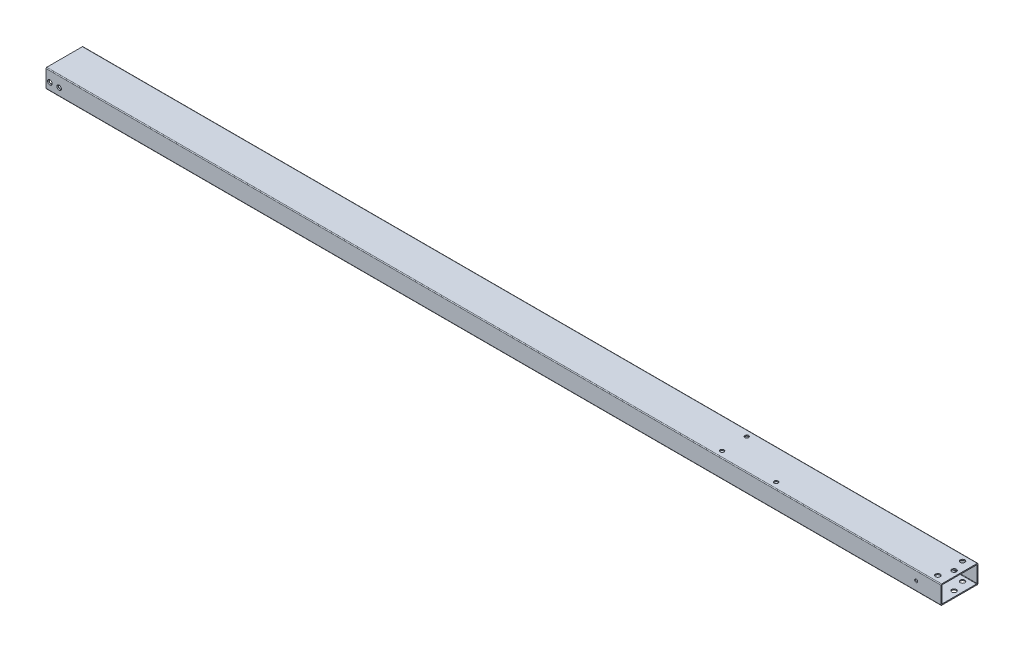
from build123d import *

# Parameters (mm, degrees)
SKETCH1_W           = 76.2
SKETCH1_H           = 38.1
SKETCH1_W_2         = 71.9836
SKETCH1_H_2         = 33.8836
EXTRUDE_THIN1_DEPTH = 1838.325
FILLET1_R           = 0.7874
FILLET2_R           = 1.5748
SKETCH3_R           = 4.7625
SKETCH3_R_2         = 3.9624
CUT_EXTRUDE1_DEPTH  = 25.4
SKETCH4_R           = 3.175
CUT_EXTRUDE2_DEPTH  = 50.8
CHAMFER1_SIZE       = 1.524
SKETCH5_R           = 4.7625
CUT_EXTRUDE3_DEPTH  = 58.42
SKETCH6_R           = 3.175
CUT_EXTRUDE4_DEPTH  = 50.8


with BuildPart() as part:
    # Sketch1 → Extrude-Thin1 (new body)
    with BuildSketch(Plane(origin=(0, 0, 0), x_dir=(0, 0, -1), z_dir=(1, 0, 0))):
        Rectangle(SKETCH1_W, SKETCH1_H)
        Rectangle(SKETCH1_W_2, SKETCH1_H_2, mode=Mode.SUBTRACT)
    extrude(amount=EXTRUDE_THIN1_DEPTH)

    # Fillet1
    fillet1_edges = [part.edges().sort_by_distance(p)[0] for p in [
        (919.1625, 16.9418, 35.9918),
        (919.1625, -16.9418, 35.9918),
        (919.1625, -16.9418, -35.9918),
        (919.1625, 16.9418, -35.9918),
    ]]
    fillet(fillet1_edges, radius=FILLET1_R)

    # Fillet2
    fillet2_edges = [part.edges().sort_by_distance(p)[0] for p in [
        (919.1625, 19.05, 38.1),
        (919.1625, 19.05, -38.1),
        (919.1625, -19.05, -38.1),
        (919.1625, -19.05, 38.1),
    ]]
    fillet(fillet2_edges, radius=FILLET2_R)

    # Sketch3 → Cut-Extrude1 (cut, symmetric)
    with BuildSketch(Plane(origin=(0, 0, 0), x_dir=(1, 0, 0), z_dir=(0, 1, 0))):
        with Locations(Location((1819.275, -25.4, 0), (0, 0, 90))):
            Circle(SKETCH3_R)
        with Locations(Location((1819.275, 25.4, 0), (0, 0, 90))):
            Circle(SKETCH3_R)
        with Locations(Location((1827.1998, 0, 0), (0, 0, 90))):
            Circle(SKETCH3_R)
        with Locations(Location((1376.045, 25.4, 0), (0, 0, 90))):
            Circle(SKETCH3_R_2)
        with Locations(Location((1487.17, -25.4, 0), (0, 0, 90))):
            Circle(SKETCH3_R_2)
        with Locations(Location((1376.045, -25.4, 0), (0, 0, 90))):
            Circle(SKETCH3_R_2)
    extrude(amount=CUT_EXTRUDE1_DEPTH, both=True, mode=Mode.SUBTRACT)

    # Sketch4 → Cut-Extrude2 (cut, symmetric)
    with BuildSketch(Plane.XY):
        with Locations(Location((7.9248, -3.175, 0), (0, 0, 270))):
            Circle(SKETCH4_R)
        with Locations(Location((26.9748, -3.175, 0), (0, 0, 270))):
            Circle(SKETCH4_R)
    extrude(amount=CUT_EXTRUDE2_DEPTH, both=True, mode=Mode.SUBTRACT)

    # Chamfer1
    chamfer1_edges = [part.edges().sort_by_distance(p)[0] for p in [
        (7.9248, 0, 38.1),
        (7.9248, 0, -38.1),
        (26.9748, 0, 38.1),
        (26.9748, 0, -38.1),
    ]]
    chamfer(chamfer1_edges, length=CHAMFER1_SIZE)

    # Sketch5 → Cut-Extrude3 (cut)
    with BuildSketch(Plane(origin=(0, 0, 0), x_dir=(1, 0, 0), z_dir=(0, 1, 0))):
        with Locations(Location((17.4498, 14.2875, 0), (0, 0, 270))):
            Circle(SKETCH5_R)
        with Locations(Location((17.4498, -14.2875, 0), (0, 0, 270))):
            Circle(SKETCH5_R)
    extrude(amount=-CUT_EXTRUDE3_DEPTH, mode=Mode.SUBTRACT)

    # Sketch6 → Cut-Extrude4 (cut, symmetric)
    with BuildSketch(Plane.XY):
        with Locations(Location((1787.525, 0, 0), (0, 0, 270))):
            Circle(SKETCH6_R)
    extrude(amount=CUT_EXTRUDE4_DEPTH, both=True, mode=Mode.SUBTRACT)


solid = part.part
